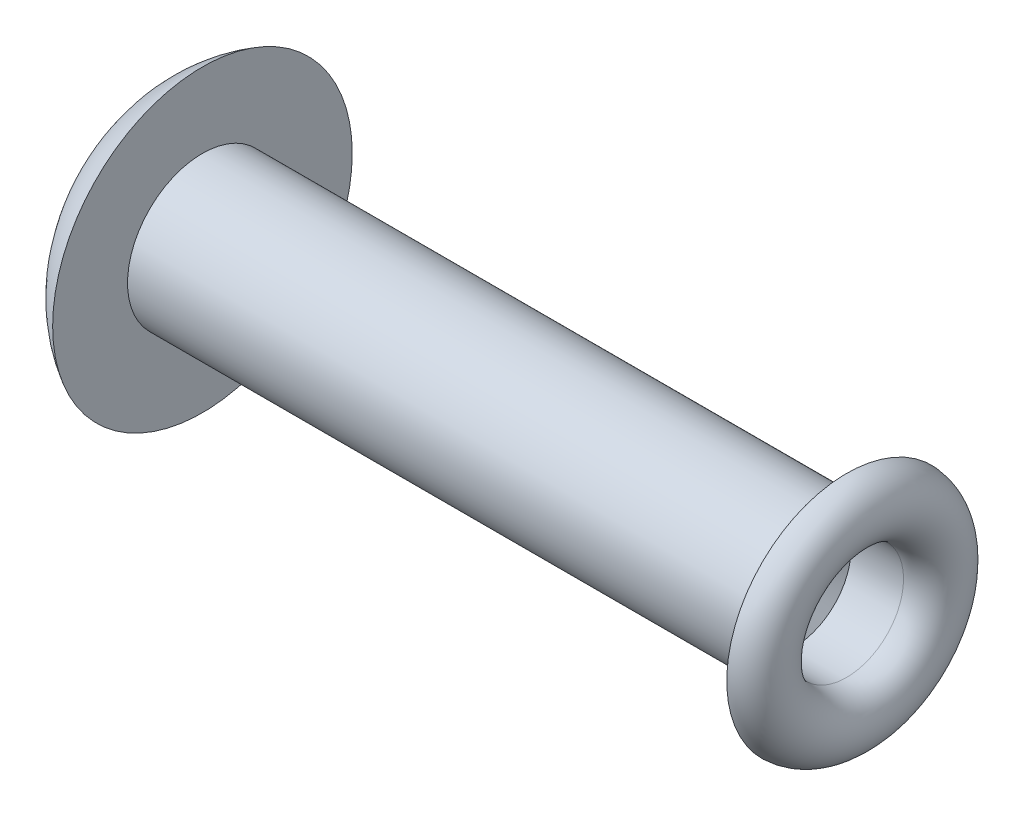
ISO-10303-21;
HEADER;
FILE_DESCRIPTION(('STEP AP214'),'2;1');
FILE_NAME('part.step','',(''),(''),'','','');
FILE_SCHEMA(('AUTOMOTIVE_DESIGN { 1 0 10303 214 1 1 1 1 }'));
ENDSEC;
DATA;
#1=APPLICATION_CONTEXT('core data for automotive mechanical design processes');
#2=APPLICATION_PROTOCOL_DEFINITION('international standard','automotive_design',2000,#1);
#3=PRODUCT_CONTEXT('',#1,'mechanical');
#4=PRODUCT('Part','Part','',(#3));
#5=PRODUCT_RELATED_PRODUCT_CATEGORY('part','',(#4));
#6=PRODUCT_DEFINITION_FORMATION('','',#4);
#7=PRODUCT_DEFINITION_CONTEXT('part definition',#1,'design');
#8=PRODUCT_DEFINITION('design','',#6,#7);
#9=PRODUCT_DEFINITION_SHAPE('','',#8);
#10=(LENGTH_UNIT() NAMED_UNIT(*) SI_UNIT(.MILLI.,.METRE.));
#11=(NAMED_UNIT(*) PLANE_ANGLE_UNIT() SI_UNIT($,.RADIAN.));
#12=(NAMED_UNIT(*) SI_UNIT($,.STERADIAN.) SOLID_ANGLE_UNIT());
#13=UNCERTAINTY_MEASURE_WITH_UNIT(LENGTH_MEASURE(1.E-05),#10,'distance_accuracy_value','');
#14=(GEOMETRIC_REPRESENTATION_CONTEXT(3) GLOBAL_UNCERTAINTY_ASSIGNED_CONTEXT((#13)) GLOBAL_UNIT_ASSIGNED_CONTEXT((#10,
#11,#12)) REPRESENTATION_CONTEXT('',''));
#15=CARTESIAN_POINT('',(0.,0.,0.));
#16=DIRECTION('',(0.,0.,1.));
#17=DIRECTION('',(1.,0.,0.));
#18=AXIS2_PLACEMENT_3D('',#15,#16,#17);
#19=CARTESIAN_POINT('',(-43.,4.99999999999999,0.));
#20=DIRECTION('',(1.,0.,0.));
#21=DIRECTION('',(0.,0.,-1.));
#22=AXIS2_PLACEMENT_3D('',#19,#20,#21);
#23=PLANE('',#22);
#24=CARTESIAN_POINT('',(-43.,0.,0.));
#25=DIRECTION('',(1.,0.,0.));
#26=DIRECTION('',(0.,0.,-1.));
#27=AXIS2_PLACEMENT_3D('',#24,#25,#26);
#28=CIRCLE('',#27,9.99999999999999);
#29=CARTESIAN_POINT('',(-43.,0.,-9.99999999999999));
#30=VERTEX_POINT('',#29);
#31=EDGE_CURVE('E11',#30,#30,#28,.T.);
#32=ORIENTED_EDGE('',*,*,#31,.T.);
#33=EDGE_LOOP('',(#32));
#34=FACE_BOUND('',#33,.T.);
#35=CARTESIAN_POINT('',(-43.,0.,0.));
#36=DIRECTION('',(1.,0.,0.));
#37=DIRECTION('',(0.,0.,-1.));
#38=AXIS2_PLACEMENT_3D('',#35,#36,#37);
#39=CIRCLE('',#38,4.99999999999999);
#40=CARTESIAN_POINT('',(-43.,0.,-4.99999999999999));
#41=VERTEX_POINT('',#40);
#42=EDGE_CURVE('E69',#41,#41,#39,.T.);
#43=ORIENTED_EDGE('',*,*,#42,.F.);
#44=EDGE_LOOP('',(#43));
#45=FACE_BOUND('',#44,.T.);
#46=ADVANCED_FACE('F33',(#34,#45),#23,.T.);
#47=CARTESIAN_POINT('',(-38.8079545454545,0.,0.));
#48=DIRECTION('',(1.,0.,0.));
#49=DIRECTION('',(0.,0.,-1.));
#50=AXIS2_PLACEMENT_3D('',#47,#48,#49);
#51=DEGENERATE_TOROIDAL_SURFACE('',#50,2.49999999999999,8.59204545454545,.T.);
#52=CARTESIAN_POINT('',(-47.4,0.,0.));
#53=DIRECTION('',(1.,0.,0.));
#54=DIRECTION('',(0.,0.,-1.));
#55=AXIS2_PLACEMENT_3D('',#52,#53,#54);
#56=CIRCLE('',#55,2.49999999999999);
#57=CARTESIAN_POINT('',(-47.4,0.,-2.49999999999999));
#58=VERTEX_POINT('',#57);
#59=EDGE_CURVE('E39',#58,#58,#56,.T.);
#60=ORIENTED_EDGE('',*,*,#59,.T.);
#61=EDGE_LOOP('',(#60));
#62=FACE_BOUND('',#61,.T.);
#63=ORIENTED_EDGE('',*,*,#31,.F.);
#64=EDGE_LOOP('',(#63));
#65=FACE_BOUND('',#64,.T.);
#66=ADVANCED_FACE('F55',(#62,#65),#51,.T.);
#67=CARTESIAN_POINT('',(-47.4,0.,0.));
#68=DIRECTION('',(-1.,0.,0.));
#69=DIRECTION('',(0.,0.,1.));
#70=AXIS2_PLACEMENT_3D('',#67,#68,#69);
#71=PLANE('',#70);
#72=ORIENTED_EDGE('',*,*,#59,.F.);
#73=EDGE_LOOP('',(#72));
#74=FACE_BOUND('',#73,.T.);
#75=ADVANCED_FACE('F45',(#74),#71,.T.);
#76=CARTESIAN_POINT('',(-5.78327035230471,0.,0.));
#77=DIRECTION('',(1.,0.,0.));
#78=DIRECTION('',(0.,0.,-1.));
#79=AXIS2_PLACEMENT_3D('',#76,#77,#78);
#80=CONICAL_SURFACE('',#79,0.,1.02974425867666);
#81=CARTESIAN_POINT('',(-3.5,0.,0.));
#82=DIRECTION('',(1.,0.,0.));
#83=DIRECTION('',(0.,0.,-1.));
#84=AXIS2_PLACEMENT_3D('',#81,#82,#83);
#85=CIRCLE('',#84,3.79999999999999);
#86=CARTESIAN_POINT('',(-3.5,0.,-3.79999999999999));
#87=VERTEX_POINT('',#86);
#88=EDGE_CURVE('E85',#87,#87,#85,.T.);
#89=ORIENTED_EDGE('',*,*,#88,.T.);
#90=EDGE_LOOP('',(#89));
#91=FACE_BOUND('',#90,.T.);
#92=CARTESIAN_POINT('',(-5.78327035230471,0.,0.));
#93=VERTEX_POINT('',#92);
#94=VERTEX_LOOP('',#93);
#95=FACE_BOUND('',#94,.T.);
#96=ADVANCED_FACE('F42',(#91,#95),#80,.F.);
#97=CARTESIAN_POINT('',(40.3769281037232,0.,0.));
#98=DIRECTION('',(1.,0.,0.));
#99=DIRECTION('',(0.,0.,-1.));
#100=AXIS2_PLACEMENT_3D('',#97,#98,#99);
#101=CYLINDRICAL_SURFACE('',#100,3.8);
#102=CARTESIAN_POINT('',(0.,0.,0.));
#103=DIRECTION('',(1.,0.,0.));
#104=DIRECTION('',(0.,0.,-1.));
#105=AXIS2_PLACEMENT_3D('',#102,#103,#104);
#106=CIRCLE('',#105,3.8);
#107=CARTESIAN_POINT('',(0.,0.,-3.8));
#108=VERTEX_POINT('',#107);
#109=EDGE_CURVE('E82',#108,#108,#106,.T.);
#110=ORIENTED_EDGE('',*,*,#109,.T.);
#111=EDGE_LOOP('',(#110));
#112=FACE_BOUND('',#111,.T.);
#113=ORIENTED_EDGE('',*,*,#88,.F.);
#114=EDGE_LOOP('',(#113));
#115=FACE_BOUND('',#114,.T.);
#116=ADVANCED_FACE('F44',(#112,#115),#101,.F.);
#117=CARTESIAN_POINT('',(-0.102499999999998,0.,0.));
#118=DIRECTION('',(1.,0.,0.));
#119=DIRECTION('',(0.,0.,-1.));
#120=AXIS2_PLACEMENT_3D('',#117,#118,#119);
#121=TOROIDAL_SURFACE('',#120,5.9,2.1025);
#122=CARTESIAN_POINT('',(0.,0.,0.));
#123=DIRECTION('',(1.,0.,0.));
#124=DIRECTION('',(0.,0.,-1.));
#125=AXIS2_PLACEMENT_3D('',#122,#123,#124);
#126=CIRCLE('',#125,8.);
#127=CARTESIAN_POINT('',(0.,0.,-8.));
#128=VERTEX_POINT('',#127);
#129=EDGE_CURVE('E79',#128,#128,#126,.T.);
#130=ORIENTED_EDGE('',*,*,#129,.T.);
#131=EDGE_LOOP('',(#130));
#132=FACE_BOUND('',#131,.T.);
#133=ORIENTED_EDGE('',*,*,#109,.F.);
#134=EDGE_LOOP('',(#133));
#135=FACE_BOUND('',#134,.T.);
#136=ADVANCED_FACE('F52',(#132,#135),#121,.T.);
#137=CARTESIAN_POINT('',(0.,8.,0.));
#138=DIRECTION('',(-1.,0.,0.));
#139=DIRECTION('',(0.,0.,1.));
#140=AXIS2_PLACEMENT_3D('',#137,#138,#139);
#141=PLANE('',#140);
#142=CARTESIAN_POINT('',(0.,0.,0.));
#143=DIRECTION('',(1.,0.,0.));
#144=DIRECTION('',(0.,0.,-1.));
#145=AXIS2_PLACEMENT_3D('',#142,#143,#144);
#146=CIRCLE('',#145,6.79414414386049);
#147=CARTESIAN_POINT('',(0.,0.,-6.79414414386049));
#148=VERTEX_POINT('',#147);
#149=EDGE_CURVE('E74',#148,#148,#146,.T.);
#150=ORIENTED_EDGE('',*,*,#149,.T.);
#151=EDGE_LOOP('',(#150));
#152=FACE_BOUND('',#151,.T.);
#153=ORIENTED_EDGE('',*,*,#129,.F.);
#154=EDGE_LOOP('',(#153));
#155=FACE_BOUND('',#154,.T.);
#156=ADVANCED_FACE('F94',(#152,#155),#141,.T.);
#157=CARTESIAN_POINT('',(-0.102499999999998,0.,0.));
#158=DIRECTION('',(1.,0.,0.));
#159=DIRECTION('',(0.,0.,-1.));
#160=AXIS2_PLACEMENT_3D('',#157,#158,#159);
#161=TOROIDAL_SURFACE('',#160,5.9,0.900000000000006);
#162=CARTESIAN_POINT('',(-0.102499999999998,0.,0.));
#163=DIRECTION('',(1.,0.,0.));
#164=DIRECTION('',(0.,0.,-1.));
#165=AXIS2_PLACEMENT_3D('',#162,#163,#164);
#166=CIRCLE('',#165,4.99999999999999);
#167=CARTESIAN_POINT('',(-0.102499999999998,0.,-4.99999999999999));
#168=VERTEX_POINT('',#167);
#169=EDGE_CURVE('E71',#168,#168,#166,.T.);
#170=ORIENTED_EDGE('',*,*,#169,.T.);
#171=EDGE_LOOP('',(#170));
#172=FACE_BOUND('',#171,.T.);
#173=ORIENTED_EDGE('',*,*,#149,.F.);
#174=EDGE_LOOP('',(#173));
#175=FACE_BOUND('',#174,.T.);
#176=ADVANCED_FACE('F100',(#172,#175),#161,.F.);
#177=CARTESIAN_POINT('',(40.3769281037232,0.,0.));
#178=DIRECTION('',(1.,0.,0.));
#179=DIRECTION('',(0.,0.,-1.));
#180=AXIS2_PLACEMENT_3D('',#177,#178,#179);
#181=CYLINDRICAL_SURFACE('',#180,4.99999999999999);
#182=ORIENTED_EDGE('',*,*,#42,.T.);
#183=EDGE_LOOP('',(#182));
#184=FACE_BOUND('',#183,.T.);
#185=ORIENTED_EDGE('',*,*,#169,.F.);
#186=EDGE_LOOP('',(#185));
#187=FACE_BOUND('',#186,.T.);
#188=ADVANCED_FACE('F106',(#184,#187),#181,.T.);
#189=CLOSED_SHELL('',(#46,#66,#75,#96,#116,#136,#156,#176,#188));
#190=MANIFOLD_SOLID_BREP('B2',#189);
#191=ADVANCED_BREP_SHAPE_REPRESENTATION('',(#18,#190),#14);
#192=SHAPE_DEFINITION_REPRESENTATION(#9,#191);
ENDSEC;
END-ISO-10303-21;
